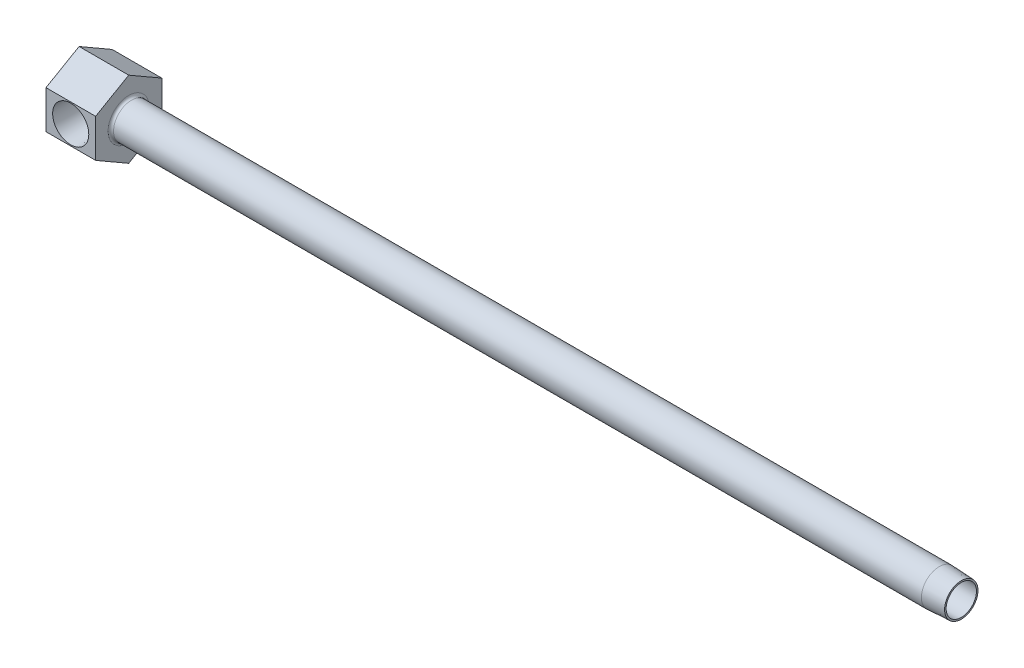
ISO-10303-21;
HEADER;
FILE_DESCRIPTION(('STEP AP214'),'2;1');
FILE_NAME('part.step','',(''),(''),'','','');
FILE_SCHEMA(('AUTOMOTIVE_DESIGN { 1 0 10303 214 1 1 1 1 }'));
ENDSEC;
DATA;
#1=APPLICATION_CONTEXT('core data for automotive mechanical design processes');
#2=APPLICATION_PROTOCOL_DEFINITION('international standard','automotive_design',2000,#1);
#3=PRODUCT_CONTEXT('',#1,'mechanical');
#4=PRODUCT('Part','Part','',(#3));
#5=PRODUCT_RELATED_PRODUCT_CATEGORY('part','',(#4));
#6=PRODUCT_DEFINITION_FORMATION('','',#4);
#7=PRODUCT_DEFINITION_CONTEXT('part definition',#1,'design');
#8=PRODUCT_DEFINITION('design','',#6,#7);
#9=PRODUCT_DEFINITION_SHAPE('','',#8);
#10=(LENGTH_UNIT() NAMED_UNIT(*) SI_UNIT(.MILLI.,.METRE.));
#11=(NAMED_UNIT(*) PLANE_ANGLE_UNIT() SI_UNIT($,.RADIAN.));
#12=(NAMED_UNIT(*) SI_UNIT($,.STERADIAN.) SOLID_ANGLE_UNIT());
#13=UNCERTAINTY_MEASURE_WITH_UNIT(LENGTH_MEASURE(1.E-05),#10,'distance_accuracy_value','');
#14=(GEOMETRIC_REPRESENTATION_CONTEXT(3) GLOBAL_UNCERTAINTY_ASSIGNED_CONTEXT((#13)) GLOBAL_UNIT_ASSIGNED_CONTEXT((#10,
#11,#12)) REPRESENTATION_CONTEXT('',''));
#15=CARTESIAN_POINT('',(0.,0.,0.));
#16=DIRECTION('',(0.,0.,1.));
#17=DIRECTION('',(1.,0.,0.));
#18=AXIS2_PLACEMENT_3D('',#15,#16,#17);
#19=CARTESIAN_POINT('',(7.14375,0.,9.525));
#20=DIRECTION('',(1.,0.,0.));
#21=DIRECTION('',(0.,0.,-1.));
#22=AXIS2_PLACEMENT_3D('',#19,#20,#21);
#23=PLANE('',#22);
#24=DIRECTION('',(0.,0.,1.));
#25=VECTOR('',#24,1.);
#26=CARTESIAN_POINT('',(7.14375,4.21628045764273,19.05));
#27=LINE('',#26,#25);
#28=CARTESIAN_POINT('',(7.14375,4.21628045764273,8.39289543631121));
#29=VERTEX_POINT('',#28);
#30=CARTESIAN_POINT('',(7.14375,4.21628045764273,10.16));
#31=VERTEX_POINT('',#30);
#32=EDGE_CURVE('E280',#29,#31,#27,.T.);
#33=ORIENTED_EDGE('',*,*,#32,.F.);
#34=CARTESIAN_POINT('',(7.14375,0.,9.525));
#35=DIRECTION('',(1.,0.,0.));
#36=DIRECTION('',(0.,0.,-1.));
#37=AXIS2_PLACEMENT_3D('',#34,#35,#36);
#38=CIRCLE('',#37,4.365625);
#39=CARTESIAN_POINT('',(7.14375,4.31919629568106,10.16));
#40=VERTEX_POINT('',#39);
#41=EDGE_CURVE('E163',#29,#40,#38,.T.);
#42=ORIENTED_EDGE('',*,*,#41,.T.);
#43=DIRECTION('',(0.,1.,0.));
#44=VECTOR('',#43,1.);
#45=CARTESIAN_POINT('',(7.14375,0.,10.16));
#46=LINE('',#45,#44);
#47=EDGE_CURVE('E153',#31,#40,#46,.T.);
#48=ORIENTED_EDGE('',*,*,#47,.F.);
#49=EDGE_LOOP('',(#33,#42,#48));
#50=FACE_BOUND('',#49,.T.);
#51=ADVANCED_FACE('F15',(#50),#23,.T.);
#52=CARTESIAN_POINT('',(14.2875,5.4992613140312,19.05));
#53=DIRECTION('',(0.,0.,-1.));
#54=DIRECTION('',(-1.,0.,0.));
#55=AXIS2_PLACEMENT_3D('',#52,#53,#54);
#56=PLANE('',#55);
#57=CARTESIAN_POINT('',(7.112,0.,19.05));
#58=DIRECTION('',(0.,0.,1.));
#59=DIRECTION('',(1.,0.,0.));
#60=AXIS2_PLACEMENT_3D('',#57,#58,#59);
#61=CIRCLE('',#60,5.2023645);
#62=CARTESIAN_POINT('',(12.3143645,0.,19.05));
#63=VERTEX_POINT('',#62);
#64=EDGE_CURVE('E269',#63,#63,#61,.T.);
#65=ORIENTED_EDGE('',*,*,#64,.F.);
#66=EDGE_LOOP('',(#65));
#67=FACE_BOUND('',#66,.T.);
#68=DIRECTION('',(0.,-1.,0.));
#69=VECTOR('',#68,1.);
#70=CARTESIAN_POINT('',(0.,5.4992613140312,19.05));
#71=LINE('',#70,#69);
#72=CARTESIAN_POINT('',(0.,5.4992613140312,19.05));
#73=VERTEX_POINT('',#72);
#74=CARTESIAN_POINT('',(0.,-5.49926131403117,19.05));
#75=VERTEX_POINT('',#74);
#76=EDGE_CURVE('E178',#73,#75,#71,.T.);
#77=ORIENTED_EDGE('',*,*,#76,.T.);
#78=DIRECTION('',(-1.,0.,0.));
#79=VECTOR('',#78,1.);
#80=CARTESIAN_POINT('',(14.2875,-5.49926131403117,19.05));
#81=LINE('',#80,#79);
#82=CARTESIAN_POINT('',(14.2875,-5.49926131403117,19.05));
#83=VERTEX_POINT('',#82);
#84=EDGE_CURVE('E201',#83,#75,#81,.T.);
#85=ORIENTED_EDGE('',*,*,#84,.F.);
#86=DIRECTION('',(0.,-1.,0.));
#87=VECTOR('',#86,1.);
#88=CARTESIAN_POINT('',(14.2875,5.4992613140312,19.05));
#89=LINE('',#88,#87);
#90=CARTESIAN_POINT('',(14.2875,5.4992613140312,19.05));
#91=VERTEX_POINT('',#90);
#92=EDGE_CURVE('E194',#91,#83,#89,.T.);
#93=ORIENTED_EDGE('',*,*,#92,.F.);
#94=DIRECTION('',(-1.,0.,0.));
#95=VECTOR('',#94,1.);
#96=CARTESIAN_POINT('',(14.2875,5.4992613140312,19.05));
#97=LINE('',#96,#95);
#98=EDGE_CURVE('E204',#91,#73,#97,.T.);
#99=ORIENTED_EDGE('',*,*,#98,.T.);
#100=EDGE_LOOP('',(#77,#85,#93,#99));
#101=FACE_BOUND('',#100,.T.);
#102=ADVANCED_FACE('F119',(#67,#101),#56,.F.);
#103=CARTESIAN_POINT('',(14.2875,-5.49926131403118,0.));
#104=DIRECTION('',(1.,0.,0.));
#105=DIRECTION('',(0.,1.,0.));
#106=AXIS2_PLACEMENT_3D('',#103,#104,#105);
#107=PLANE('',#106);
#108=CARTESIAN_POINT('',(14.2875,0.,9.525));
#109=DIRECTION('',(1.,0.,0.));
#110=DIRECTION('',(0.,1.,0.));
#111=AXIS2_PLACEMENT_3D('',#108,#109,#110);
#112=CIRCLE('',#111,5.9309);
#113=CARTESIAN_POINT('',(14.2875,5.9309,9.525));
#114=VERTEX_POINT('',#113);
#115=EDGE_CURVE('E216',#114,#114,#112,.F.);
#116=ORIENTED_EDGE('',*,*,#115,.T.);
#117=EDGE_LOOP('',(#116));
#118=FACE_BOUND('',#117,.T.);
#119=DIRECTION('',(0.,0.5,-0.866025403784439));
#120=VECTOR('',#119,1.);
#121=CARTESIAN_POINT('',(14.2875,-10.9985226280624,9.525));
#122=LINE('',#121,#120);
#123=CARTESIAN_POINT('',(14.2875,-10.9985226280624,9.525));
#124=VERTEX_POINT('',#123);
#125=CARTESIAN_POINT('',(14.2875,-5.49926131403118,0.));
#126=VERTEX_POINT('',#125);
#127=EDGE_CURVE('E184',#124,#126,#122,.T.);
#128=ORIENTED_EDGE('',*,*,#127,.T.);
#129=DIRECTION('',(0.,1.,0.));
#130=VECTOR('',#129,1.);
#131=CARTESIAN_POINT('',(14.2875,-5.49926131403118,0.));
#132=LINE('',#131,#130);
#133=CARTESIAN_POINT('',(14.2875,5.49926131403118,0.));
#134=VERTEX_POINT('',#133);
#135=EDGE_CURVE('E188',#126,#134,#132,.T.);
#136=ORIENTED_EDGE('',*,*,#135,.T.);
#137=DIRECTION('',(0.,0.5,0.866025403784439));
#138=VECTOR('',#137,1.);
#139=CARTESIAN_POINT('',(14.2875,5.49926131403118,0.));
#140=LINE('',#139,#138);
#141=CARTESIAN_POINT('',(14.2875,10.9985226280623,9.525));
#142=VERTEX_POINT('',#141);
#143=EDGE_CURVE('E190',#134,#142,#140,.T.);
#144=ORIENTED_EDGE('',*,*,#143,.T.);
#145=DIRECTION('',(0.,-0.5,0.86602540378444));
#146=VECTOR('',#145,1.);
#147=CARTESIAN_POINT('',(14.2875,10.9985226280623,9.525));
#148=LINE('',#147,#146);
#149=EDGE_CURVE('E192',#142,#91,#148,.T.);
#150=ORIENTED_EDGE('',*,*,#149,.T.);
#151=ORIENTED_EDGE('',*,*,#92,.T.);
#152=DIRECTION('',(0.,-0.5,-0.866025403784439));
#153=VECTOR('',#152,1.);
#154=CARTESIAN_POINT('',(14.2875,-5.49926131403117,19.05));
#155=LINE('',#154,#153);
#156=EDGE_CURVE('E38',#83,#124,#155,.T.);
#157=ORIENTED_EDGE('',*,*,#156,.T.);
#158=EDGE_LOOP('',(#128,#136,#144,#150,#151,#157));
#159=FACE_BOUND('',#158,.T.);
#160=ADVANCED_FACE('F127',(#118,#159),#107,.T.);
#161=CARTESIAN_POINT('',(14.2875,-10.9985226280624,9.525));
#162=DIRECTION('',(0.,0.866025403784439,0.5));
#163=DIRECTION('',(0.,-0.5,0.866025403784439));
#164=AXIS2_PLACEMENT_3D('',#161,#162,#163);
#165=PLANE('',#164);
#166=DIRECTION('',(0.,0.5,-0.866025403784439));
#167=VECTOR('',#166,1.);
#168=CARTESIAN_POINT('',(0.,-10.9985226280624,9.525));
#169=LINE('',#168,#167);
#170=CARTESIAN_POINT('',(0.,-10.9985226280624,9.525));
#171=VERTEX_POINT('',#170);
#172=CARTESIAN_POINT('',(0.,-5.49926131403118,0.));
#173=VERTEX_POINT('',#172);
#174=EDGE_CURVE('E166',#171,#173,#169,.T.);
#175=ORIENTED_EDGE('',*,*,#174,.T.);
#176=DIRECTION('',(-1.,0.,0.));
#177=VECTOR('',#176,1.);
#178=CARTESIAN_POINT('',(14.2875,-5.49926131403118,0.));
#179=LINE('',#178,#177);
#180=EDGE_CURVE('E213',#126,#173,#179,.T.);
#181=ORIENTED_EDGE('',*,*,#180,.F.);
#182=ORIENTED_EDGE('',*,*,#127,.F.);
#183=DIRECTION('',(-1.,0.,0.));
#184=VECTOR('',#183,1.);
#185=CARTESIAN_POINT('',(14.2875,-10.9985226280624,9.525));
#186=LINE('',#185,#184);
#187=EDGE_CURVE('E197',#124,#171,#186,.T.);
#188=ORIENTED_EDGE('',*,*,#187,.T.);
#189=EDGE_LOOP('',(#175,#181,#182,#188));
#190=FACE_BOUND('',#189,.T.);
#191=ADVANCED_FACE('F301',(#190),#165,.F.);
#192=CARTESIAN_POINT('',(14.2875,-5.49926131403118,0.));
#193=DIRECTION('',(0.,0.,1.));
#194=DIRECTION('',(0.,-1.,0.));
#195=AXIS2_PLACEMENT_3D('',#192,#193,#194);
#196=PLANE('',#195);
#197=DIRECTION('',(0.,1.,0.));
#198=VECTOR('',#197,1.);
#199=CARTESIAN_POINT('',(0.,-5.49926131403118,0.));
#200=LINE('',#199,#198);
#201=CARTESIAN_POINT('',(0.,5.49926131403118,0.));
#202=VERTEX_POINT('',#201);
#203=EDGE_CURVE('E169',#173,#202,#200,.T.);
#204=ORIENTED_EDGE('',*,*,#203,.T.);
#205=DIRECTION('',(-1.,0.,0.));
#206=VECTOR('',#205,1.);
#207=CARTESIAN_POINT('',(14.2875,5.49926131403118,0.));
#208=LINE('',#207,#206);
#209=EDGE_CURVE('E210',#134,#202,#208,.T.);
#210=ORIENTED_EDGE('',*,*,#209,.F.);
#211=ORIENTED_EDGE('',*,*,#135,.F.);
#212=ORIENTED_EDGE('',*,*,#180,.T.);
#213=EDGE_LOOP('',(#204,#210,#211,#212));
#214=FACE_BOUND('',#213,.T.);
#215=ADVANCED_FACE('F307',(#214),#196,.F.);
#216=CARTESIAN_POINT('',(14.2875,5.49926131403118,0.));
#217=DIRECTION('',(0.,-0.866025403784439,0.5));
#218=DIRECTION('',(0.,-0.5,-0.866025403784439));
#219=AXIS2_PLACEMENT_3D('',#216,#217,#218);
#220=PLANE('',#219);
#221=DIRECTION('',(0.,0.5,0.866025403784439));
#222=VECTOR('',#221,1.);
#223=CARTESIAN_POINT('',(0.,5.49926131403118,0.));
#224=LINE('',#223,#222);
#225=CARTESIAN_POINT('',(0.,10.9985226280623,9.525));
#226=VERTEX_POINT('',#225);
#227=EDGE_CURVE('E172',#202,#226,#224,.T.);
#228=ORIENTED_EDGE('',*,*,#227,.T.);
#229=DIRECTION('',(-1.,0.,0.));
#230=VECTOR('',#229,1.);
#231=CARTESIAN_POINT('',(14.2875,10.9985226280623,9.525));
#232=LINE('',#231,#230);
#233=EDGE_CURVE('E207',#142,#226,#232,.T.);
#234=ORIENTED_EDGE('',*,*,#233,.F.);
#235=ORIENTED_EDGE('',*,*,#143,.F.);
#236=ORIENTED_EDGE('',*,*,#209,.T.);
#237=EDGE_LOOP('',(#228,#234,#235,#236));
#238=FACE_BOUND('',#237,.T.);
#239=ADVANCED_FACE('F309',(#238),#220,.F.);
#240=CARTESIAN_POINT('',(14.2875,10.9985226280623,9.525));
#241=DIRECTION('',(0.,-0.86602540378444,-0.5));
#242=DIRECTION('',(0.,0.5,-0.86602540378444));
#243=AXIS2_PLACEMENT_3D('',#240,#241,#242);
#244=PLANE('',#243);
#245=DIRECTION('',(0.,-0.5,0.86602540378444));
#246=VECTOR('',#245,1.);
#247=CARTESIAN_POINT('',(0.,10.9985226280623,9.525));
#248=LINE('',#247,#246);
#249=EDGE_CURVE('E175',#226,#73,#248,.T.);
#250=ORIENTED_EDGE('',*,*,#249,.T.);
#251=ORIENTED_EDGE('',*,*,#98,.F.);
#252=ORIENTED_EDGE('',*,*,#149,.F.);
#253=ORIENTED_EDGE('',*,*,#233,.T.);
#254=EDGE_LOOP('',(#250,#251,#252,#253));
#255=FACE_BOUND('',#254,.T.);
#256=ADVANCED_FACE('F312',(#255),#244,.F.);
#257=CARTESIAN_POINT('',(14.2875,-5.49926131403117,19.05));
#258=DIRECTION('',(0.,0.866025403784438,-0.5));
#259=DIRECTION('',(0.,0.5,0.866025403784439));
#260=AXIS2_PLACEMENT_3D('',#257,#258,#259);
#261=PLANE('',#260);
#262=DIRECTION('',(0.,-0.5,-0.866025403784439));
#263=VECTOR('',#262,1.);
#264=CARTESIAN_POINT('',(0.,-5.49926131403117,19.05));
#265=LINE('',#264,#263);
#266=EDGE_CURVE('E181',#75,#171,#265,.T.);
#267=ORIENTED_EDGE('',*,*,#266,.T.);
#268=ORIENTED_EDGE('',*,*,#187,.F.);
#269=ORIENTED_EDGE('',*,*,#156,.F.);
#270=ORIENTED_EDGE('',*,*,#84,.T.);
#271=EDGE_LOOP('',(#267,#268,#269,#270));
#272=FACE_BOUND('',#271,.T.);
#273=ADVANCED_FACE('F296',(#272),#261,.F.);
#274=CARTESIAN_POINT('',(0.,-5.49926131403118,0.));
#275=DIRECTION('',(1.,0.,0.));
#276=DIRECTION('',(0.,1.,0.));
#277=AXIS2_PLACEMENT_3D('',#274,#275,#276);
#278=PLANE('',#277);
#279=ORIENTED_EDGE('',*,*,#174,.F.);
#280=ORIENTED_EDGE('',*,*,#266,.F.);
#281=ORIENTED_EDGE('',*,*,#76,.F.);
#282=ORIENTED_EDGE('',*,*,#249,.F.);
#283=ORIENTED_EDGE('',*,*,#227,.F.);
#284=ORIENTED_EDGE('',*,*,#203,.F.);
#285=EDGE_LOOP('',(#279,#280,#281,#282,#283,#284));
#286=FACE_BOUND('',#285,.T.);
#287=ADVANCED_FACE('F141',(#286),#278,.F.);
#288=CARTESIAN_POINT('',(68.0114010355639,0.,9.525));
#289=DIRECTION('',(-1.,0.,0.));
#290=DIRECTION('',(0.,0.,1.));
#291=AXIS2_PLACEMENT_3D('',#288,#289,#290);
#292=CYLINDRICAL_SURFACE('',#291,5.1435);
#293=CARTESIAN_POINT('',(247.65,0.,9.525));
#294=DIRECTION('',(-1.,0.,0.));
#295=DIRECTION('',(0.,0.,1.));
#296=AXIS2_PLACEMENT_3D('',#293,#294,#295);
#297=CIRCLE('',#296,5.1435);
#298=CARTESIAN_POINT('',(247.65,0.,14.6685));
#299=VERTEX_POINT('',#298);
#300=EDGE_CURVE('E10',#299,#299,#297,.F.);
#301=ORIENTED_EDGE('',*,*,#300,.F.);
#302=EDGE_LOOP('',(#301));
#303=FACE_BOUND('',#302,.T.);
#304=CARTESIAN_POINT('',(15.0749,0.,9.525));
#305=DIRECTION('',(1.,0.,0.));
#306=DIRECTION('',(0.,1.,0.));
#307=AXIS2_PLACEMENT_3D('',#304,#305,#306);
#308=CIRCLE('',#307,5.1435);
#309=CARTESIAN_POINT('',(15.0749,5.1435,9.525));
#310=VERTEX_POINT('',#309);
#311=EDGE_CURVE('E219',#310,#310,#308,.T.);
#312=ORIENTED_EDGE('',*,*,#311,.T.);
#313=EDGE_LOOP('',(#312));
#314=FACE_BOUND('',#313,.T.);
#315=ADVANCED_FACE('F17',(#303,#314),#292,.T.);
#316=CARTESIAN_POINT('',(7.14375,-4.31919629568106,10.16));
#317=VERTEX_POINT('',#316);
#318=CARTESIAN_POINT('',(7.14375,-4.21628045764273,10.16));
#319=VERTEX_POINT('',#318);
#320=EDGE_CURVE('E146',#317,#319,#46,.T.);
#321=ORIENTED_EDGE('',*,*,#320,.F.);
#322=CARTESIAN_POINT('',(7.14375,-4.21628045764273,8.39289543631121));
#323=VERTEX_POINT('',#322);
#324=EDGE_CURVE('E148',#317,#323,#38,.T.);
#325=ORIENTED_EDGE('',*,*,#324,.T.);
#326=DIRECTION('',(0.,0.,1.));
#327=VECTOR('',#326,1.);
#328=CARTESIAN_POINT('',(7.14375,-4.21628045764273,19.05));
#329=LINE('',#328,#327);
#330=EDGE_CURVE('E149',#319,#323,#329,.F.);
#331=ORIENTED_EDGE('',*,*,#330,.F.);
#332=EDGE_LOOP('',(#321,#325,#331));
#333=FACE_BOUND('',#332,.T.);
#334=ADVANCED_FACE('F122',(#333),#23,.T.);
#335=CARTESIAN_POINT('',(66.1375087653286,0.,9.525));
#336=DIRECTION('',(1.,0.,0.));
#337=DIRECTION('',(0.,0.,-1.));
#338=AXIS2_PLACEMENT_3D('',#335,#336,#337);
#339=CYLINDRICAL_SURFACE('',#338,4.365625);
#340=DIRECTION('',(1.,0.,0.));
#341=VECTOR('',#340,1.);
#342=CARTESIAN_POINT('',(66.1375087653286,4.31919629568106,10.16));
#343=LINE('',#342,#341);
#344=CARTESIAN_POINT('',(9.50166012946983,4.31919629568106,10.16));
#345=VERTEX_POINT('',#344);
#346=EDGE_CURVE('E23',#40,#345,#343,.T.);
#347=ORIENTED_EDGE('',*,*,#346,.F.);
#348=ORIENTED_EDGE('',*,*,#41,.F.);
#349=CARTESIAN_POINT('',(11.0152606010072,1.5945487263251,5.461));
#350=CARTESIAN_POINT('',(10.9690910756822,1.7075595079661,5.50534166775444));
#351=CARTESIAN_POINT('',(10.9186455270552,1.81703423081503,5.55373339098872));
#352=CARTESIAN_POINT('',(10.810302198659,2.02846645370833,5.65746242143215));
#353=CARTESIAN_POINT('',(10.7524192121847,2.13043826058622,5.71278593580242));
#354=CARTESIAN_POINT('',(10.5698905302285,2.42358040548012,5.88682744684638));
#355=CARTESIAN_POINT('',(10.4356317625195,2.6037024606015,6.01432367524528));
#356=CARTESIAN_POINT('',(10.2004726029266,2.87382153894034,6.2358690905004));
#357=CARTESIAN_POINT('',(10.1051285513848,2.97281573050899,6.32528321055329));
#358=CARTESIAN_POINT('',(9.90783434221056,3.15907014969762,6.50903483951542));
#359=CARTESIAN_POINT('',(9.80588273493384,3.2463277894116,6.60337342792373));
#360=CARTESIAN_POINT('',(9.59613587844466,3.40951469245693,6.79556583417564));
#361=CARTESIAN_POINT('',(9.48833347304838,3.48542963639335,6.89342390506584));
#362=CARTESIAN_POINT('',(9.26745878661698,3.62617881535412,7.09103053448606));
#363=CARTESIAN_POINT('',(9.15438825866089,3.69101670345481,7.19077845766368));
#364=CARTESIAN_POINT('',(8.91700112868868,3.81296593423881,7.39547820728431));
#365=CARTESIAN_POINT('',(8.79240497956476,3.86952009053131,7.50043788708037));
#366=CARTESIAN_POINT('',(8.53587575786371,3.97111492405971,7.70779573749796));
#367=CARTESIAN_POINT('',(8.40392330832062,4.01612325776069,7.81018600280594));
#368=CARTESIAN_POINT('',(8.16304729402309,4.0847277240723,7.98226690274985));
#369=CARTESIAN_POINT('',(8.0562781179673,4.11086974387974,8.05387458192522));
#370=CARTESIAN_POINT('',(7.89027521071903,4.14432560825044,8.15224503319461));
#371=CARTESIAN_POINT('',(7.83425575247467,4.15448196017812,8.18339689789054));
#372=CARTESIAN_POINT('',(7.71975817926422,4.17277321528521,8.24142733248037));
#373=CARTESIAN_POINT('',(7.6612817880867,4.18090950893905,8.26830883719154));
#374=CARTESIAN_POINT('',(7.52931857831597,4.19631734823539,8.32062856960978));
#375=CARTESIAN_POINT('',(7.45518069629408,4.2030846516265,8.34468558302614));
#376=CARTESIAN_POINT('',(7.30234246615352,4.21282137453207,8.37996487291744));
#377=CARTESIAN_POINT('',(7.22358315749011,4.21571837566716,8.39094201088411));
#378=CARTESIAN_POINT('',(7.14374999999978,4.21628045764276,8.39289543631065));
#379=B_SPLINE_CURVE_WITH_KNOTS('',3,(#349,#350,#351,#352,#353,#354,#355,#356,#357,#358,#359,
#360,#361,#362,#363,#364,#365,#366,#367,#368,#369,#370,#371,#372,#373,#374,#375,#376,#377,#378),
.UNSPECIFIED.,.F.,.F.,(4,2,2,2,2,2,2,2,2,2,2,2,2,2,4),(0.,0.389178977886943,0.777595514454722,
1.54850925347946,2.03989074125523,2.5313804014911,3.02348538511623,3.51542776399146,
4.03226982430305,4.5505442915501,4.94339994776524,5.13792303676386,5.33231185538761,
5.56585330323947,5.80370611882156),.UNSPECIFIED.);
#380=CARTESIAN_POINT('',(11.0152606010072,1.5945487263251,5.461));
#381=VERTEX_POINT('',#380);
#382=EDGE_CURVE('E222',#381,#29,#379,.T.);
#383=ORIENTED_EDGE('',*,*,#382,.F.);
#384=CARTESIAN_POINT('',(11.038608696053,-1.66986531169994,5.4913625));
#385=CARTESIAN_POINT('',(11.0105354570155,-1.5831922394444,5.45544731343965));
#386=CARTESIAN_POINT('',(10.985979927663,-1.49442111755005,5.422003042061));
#387=CARTESIAN_POINT('',(10.9431209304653,-1.31365154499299,5.36062405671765));
#388=CARTESIAN_POINT('',(10.9248095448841,-1.22165734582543,5.3326823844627));
#389=CARTESIAN_POINT('',(10.8936059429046,-1.03529168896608,5.28281066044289));
#390=CARTESIAN_POINT('',(10.8807075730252,-0.94092306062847,5.26087379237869));
#391=CARTESIAN_POINT('',(10.8594086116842,-0.750424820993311,5.22325970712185));
#392=CARTESIAN_POINT('',(10.8510094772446,-0.654294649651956,5.20758451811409));
#393=CARTESIAN_POINT('',(10.8381415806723,-0.463156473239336,5.18296779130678));
#394=CARTESIAN_POINT('',(10.8335877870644,-0.368172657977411,5.1738812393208));
#395=CARTESIAN_POINT('',(10.8276558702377,-0.177678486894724,5.16194794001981));
#396=CARTESIAN_POINT('',(10.8262790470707,-0.0821679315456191,5.15910374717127));
#397=CARTESIAN_POINT('',(10.826564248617,0.108822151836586,5.15968693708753));
#398=CARTESIAN_POINT('',(10.828226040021,0.204301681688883,5.16311383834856));
#399=CARTESIAN_POINT('',(10.8347557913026,0.3946850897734,5.17620642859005));
#400=CARTESIAN_POINT('',(10.8396224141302,0.489589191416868,5.18586951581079));
#401=CARTESIAN_POINT('',(10.8530224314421,0.678329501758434,5.2113452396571));
#402=CARTESIAN_POINT('',(10.861556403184,0.772165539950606,5.22715884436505));
#403=CARTESIAN_POINT('',(10.882977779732,0.958108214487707,5.26475262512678));
#404=CARTESIAN_POINT('',(10.8958637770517,1.05021539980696,5.28653087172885));
#405=CARTESIAN_POINT('',(10.9268394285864,1.23213175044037,5.33579934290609));
#406=CARTESIAN_POINT('',(10.9449350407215,1.32193815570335,5.36329609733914));
#407=CARTESIAN_POINT('',(10.9870994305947,1.49845562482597,5.42352620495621));
#408=CARTESIAN_POINT('',(11.0111754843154,1.58516276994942,5.45626591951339));
#409=CARTESIAN_POINT('',(11.038608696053,1.66986531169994,5.4913625));
#410=B_SPLINE_CURVE_WITH_KNOTS('',3,(#384,#385,#386,#387,#388,#389,#390,#391,#392,#393,#394,
#395,#396,#397,#398,#399,#400,#401,#402,#403,#404,#405,#406,#407,#408,#409),.UNSPECIFIED.,.F.,
.F.,(4,2,2,2,2,2,2,2,2,2,2,2,4),(0.,0.293591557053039,0.586809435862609,0.879693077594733,
1.17267150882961,1.45898777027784,1.74542117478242,2.03183258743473,2.31812458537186,
2.60446166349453,2.89070622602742,3.17727945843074,3.46420306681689),.UNSPECIFIED.);
#411=CARTESIAN_POINT('',(11.0152606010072,-1.5945487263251,5.461));
#412=VERTEX_POINT('',#411);
#413=EDGE_CURVE('E227',#412,#381,#410,.T.);
#414=ORIENTED_EDGE('',*,*,#413,.F.);
#415=CARTESIAN_POINT('',(7.14375,-4.21628045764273,8.39289543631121));
#416=CARTESIAN_POINT('',(7.18362399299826,-4.21598583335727,8.39181806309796));
#417=CARTESIAN_POINT('',(7.22338201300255,-4.21511517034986,8.38855660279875));
#418=CARTESIAN_POINT('',(7.30220974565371,-4.21229002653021,8.3781194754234));
#419=CARTESIAN_POINT('',(7.34128135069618,-4.21033927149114,8.37095726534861));
#420=CARTESIAN_POINT('',(7.45558593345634,-4.20306181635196,8.34463096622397));
#421=CARTESIAN_POINT('',(7.52959005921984,-4.19629141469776,8.32054287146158));
#422=CARTESIAN_POINT('',(7.67793141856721,-4.17895935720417,8.2616842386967));
#423=CARTESIAN_POINT('',(7.75200183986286,-4.16818767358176,8.22634138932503));
#424=CARTESIAN_POINT('',(7.89635080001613,-4.14345087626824,8.14945009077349));
#425=CARTESIAN_POINT('',(7.96662283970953,-4.12948049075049,8.10789143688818));
#426=CARTESIAN_POINT('',(8.10525974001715,-4.09836535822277,8.02024615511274));
#427=CARTESIAN_POINT('',(8.17357097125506,-4.08117012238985,7.97409391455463));
#428=CARTESIAN_POINT('',(8.30769836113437,-4.04390532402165,7.87936489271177));
#429=CARTESIAN_POINT('',(8.37351346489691,-4.02383456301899,7.83078710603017));
#430=CARTESIAN_POINT('',(8.57859672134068,-3.95588469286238,7.67482924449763));
#431=CARTESIAN_POINT('',(8.71418056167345,-3.90283307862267,7.56482866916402));
#432=CARTESIAN_POINT('',(8.97841531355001,-3.78358080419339,7.34346052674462));
#433=CARTESIAN_POINT('',(9.10705932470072,-3.71736735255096,7.23209172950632));
#434=CARTESIAN_POINT('',(9.35705912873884,-3.57190642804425,7.01153592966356));
#435=CARTESIAN_POINT('',(9.47845600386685,-3.49274436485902,6.90233956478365));
#436=CARTESIAN_POINT('',(9.71438396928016,-3.32067953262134,6.68762551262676));
#437=CARTESIAN_POINT('',(9.82891987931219,-3.22778657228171,6.58210526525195));
#438=CARTESIAN_POINT('',(10.0969445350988,-2.98549279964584,6.33327532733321));
#439=CARTESIAN_POINT('',(10.2465325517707,-2.82876640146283,6.19275827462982));
#440=CARTESIAN_POINT('',(10.5251240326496,-2.48539491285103,5.92944140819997));
#441=CARTESIAN_POINT('',(10.6541872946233,-2.29884003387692,5.80659022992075));
#442=CARTESIAN_POINT('',(10.815064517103,-2.01834728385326,5.65289947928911));
#443=CARTESIAN_POINT('',(10.8584525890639,-1.93670806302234,5.61137999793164));
#444=CARTESIAN_POINT('',(10.9405236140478,-1.76894321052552,5.53274400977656));
#445=CARTESIAN_POINT('',(10.9792015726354,-1.6828129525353,5.49563217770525));
#446=CARTESIAN_POINT('',(11.0152606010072,-1.5945487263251,5.461));
#447=B_SPLINE_CURVE_WITH_KNOTS('',3,(#415,#416,#417,#418,#419,#420,#421,#422,#423,#424,#425,
#426,#427,#428,#429,#430,#431,#432,#433,#434,#435,#436,#437,#438,#439,#440,#441,#442,#443,#444,
#445,#446),.UNSPECIFIED.,.F.,.F.,(4,2,2,2,2,2,2,2,2,2,2,2,2,2,2,4),(0.,0.119524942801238,
0.238640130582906,0.471907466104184,0.719716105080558,0.967936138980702,1.2204276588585,
1.47302472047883,2.01967972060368,2.56686861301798,3.1105838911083,3.65391262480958,
4.4259772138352,5.19574951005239,5.49953103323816,5.80363192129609),.UNSPECIFIED.);
#448=EDGE_CURVE('E162',#323,#412,#447,.T.);
#449=ORIENTED_EDGE('',*,*,#448,.F.);
#450=ORIENTED_EDGE('',*,*,#324,.F.);
#451=DIRECTION('',(1.,0.,0.));
#452=VECTOR('',#451,1.);
#453=CARTESIAN_POINT('',(66.1375087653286,-4.31919629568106,10.16));
#454=LINE('',#453,#452);
#455=CARTESIAN_POINT('',(9.50166012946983,-4.31919629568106,10.16));
#456=VERTEX_POINT('',#455);
#457=EDGE_CURVE('E160',#456,#317,#454,.F.);
#458=ORIENTED_EDGE('',*,*,#457,.F.);
#459=CARTESIAN_POINT('',(9.50159462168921,4.31922569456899,10.1598));
#460=CARTESIAN_POINT('',(9.52205476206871,4.31004461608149,10.2222542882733));
#461=CARTESIAN_POINT('',(9.54440879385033,4.29961032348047,10.2838517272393));
#462=CARTESIAN_POINT('',(9.592244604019,4.27639816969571,10.4052958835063));
#463=CARTESIAN_POINT('',(9.61772301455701,4.26362282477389,10.4651444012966));
#464=CARTESIAN_POINT('',(9.6977084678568,4.22211002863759,10.641720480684));
#465=CARTESIAN_POINT('',(9.75594525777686,4.19010742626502,10.7559937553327));
#466=CARTESIAN_POINT('',(9.87844694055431,4.11827910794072,10.9783012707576));
#467=CARTESIAN_POINT('',(9.94270165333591,4.07846648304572,11.0863455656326));
#468=CARTESIAN_POINT('',(10.0748723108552,3.9913538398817,11.2972300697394));
#469=CARTESIAN_POINT('',(10.1427929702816,3.94404402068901,11.4000632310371));
#470=CARTESIAN_POINT('',(10.298774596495,3.82856370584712,11.6276502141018));
#471=CARTESIAN_POINT('',(10.3873705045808,3.75819622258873,11.7509249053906));
#472=CARTESIAN_POINT('',(10.5646676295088,3.60591330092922,11.9899830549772));
#473=CARTESIAN_POINT('',(10.6533688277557,3.52399966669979,12.1057676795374));
#474=CARTESIAN_POINT('',(10.828903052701,3.34837324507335,12.3298815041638));
#475=CARTESIAN_POINT('',(10.9157338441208,3.25464716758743,12.4382020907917));
#476=CARTESIAN_POINT('',(11.0854790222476,3.05533823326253,12.6465978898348));
#477=CARTESIAN_POINT('',(11.1683947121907,2.94975936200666,12.746675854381));
#478=CARTESIAN_POINT('',(11.3637298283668,2.67738871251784,12.9797077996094));
#479=CARTESIAN_POINT('',(11.4730979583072,2.50408908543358,13.1077769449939));
#480=CARTESIAN_POINT('',(11.6736784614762,2.13317678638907,13.3402290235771));
#481=CARTESIAN_POINT('',(11.764930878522,1.93561933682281,13.444664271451));
#482=CARTESIAN_POINT('',(11.9092563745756,1.55445058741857,13.608817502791));
#483=CARTESIAN_POINT('',(11.9662034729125,1.37434002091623,13.6731460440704));
#484=CARTESIAN_POINT('',(12.036275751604,1.09545803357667,13.7520594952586));
#485=CARTESIAN_POINT('',(12.0570798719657,1.00100886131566,13.7754393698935));
#486=CARTESIAN_POINT('',(12.093196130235,0.80976989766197,13.8159777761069));
#487=CARTESIAN_POINT('',(12.1085105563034,0.712981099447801,13.8331388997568));
#488=CARTESIAN_POINT('',(12.1334016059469,0.517219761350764,13.861011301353));
#489=CARTESIAN_POINT('',(12.1429475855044,0.418238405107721,13.8716881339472));
#490=CARTESIAN_POINT('',(12.1559671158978,0.219418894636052,13.8862461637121));
#491=CARTESIAN_POINT('',(12.159443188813,0.119581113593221,13.8901301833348));
#492=CARTESIAN_POINT('',(12.1602489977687,-0.0801622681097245,13.8910308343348));
#493=CARTESIAN_POINT('',(12.157578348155,-0.180067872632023,13.8880470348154));
#494=CARTESIAN_POINT('',(12.1461610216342,-0.379063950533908,13.87528173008));
#495=CARTESIAN_POINT('',(12.1374146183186,-0.478154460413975,13.8655005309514));
#496=CARTESIAN_POINT('',(12.1041501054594,-0.757548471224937,13.8282625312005));
#497=CARTESIAN_POINT('',(12.0725539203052,-0.936048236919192,13.7928583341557));
#498=CARTESIAN_POINT('',(11.9914510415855,-1.28332325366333,13.701614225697));
#499=CARTESIAN_POINT('',(11.9419389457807,-1.45209555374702,13.645768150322));
#500=CARTESIAN_POINT('',(11.8234161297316,-1.78986703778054,13.5113020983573));
#501=CARTESIAN_POINT('',(11.7531886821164,-1.95786359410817,13.4312490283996));
#502=CARTESIAN_POINT('',(11.5990616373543,-2.2774775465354,13.2539727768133));
#503=CARTESIAN_POINT('',(11.515160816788,-2.42909347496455,13.1567480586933));
#504=CARTESIAN_POINT('',(11.2893838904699,-2.79222476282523,12.8919364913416));
#505=CARTESIAN_POINT('',(11.1405152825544,-2.99235864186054,12.7145443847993));
#506=CARTESIAN_POINT('',(10.9077049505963,-3.26312100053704,12.4281267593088));
#507=CARTESIAN_POINT('',(10.8282461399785,-3.34869576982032,12.3289140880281));
#508=CARTESIAN_POINT('',(10.6676325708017,-3.51003537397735,12.1240974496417));
#509=CARTESIAN_POINT('',(10.5864785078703,-3.58580414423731,12.0184960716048));
#510=CARTESIAN_POINT('',(10.4220303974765,-3.72941202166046,11.798300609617));
#511=CARTESIAN_POINT('',(10.338734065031,-3.79700254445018,11.6835467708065));
#512=CARTESIAN_POINT('',(10.1740816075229,-3.92201333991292,11.4470806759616));
#513=CARTESIAN_POINT('',(10.092727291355,-3.97942442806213,11.3253622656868));
#514=CARTESIAN_POINT('',(9.93568225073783,-4.08324264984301,11.0754774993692));
#515=CARTESIAN_POINT('',(9.85994825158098,-4.12974154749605,10.9473767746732));
#516=CARTESIAN_POINT('',(9.71779756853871,-4.21155620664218,10.6828322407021));
#517=CARTESIAN_POINT('',(9.65135922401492,-4.24689821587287,10.5464089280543));
#518=CARTESIAN_POINT('',(9.57628126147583,-4.28419371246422,10.3652627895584));
#519=CARTESIAN_POINT('',(9.56028735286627,-4.29194911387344,10.3247361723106));
#520=CARTESIAN_POINT('',(9.52977406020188,-4.30640007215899,10.2428664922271));
#521=CARTESIAN_POINT('',(9.51525722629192,-4.31309380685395,10.2015221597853));
#522=CARTESIAN_POINT('',(9.50159462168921,-4.31922569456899,10.1598));
#523=B_SPLINE_CURVE_WITH_KNOTS('',3,(#459,#460,#461,#462,#463,#464,#465,#466,#467,#468,#469,
#470,#471,#472,#473,#474,#475,#476,#477,#478,#479,#480,#481,#482,#483,#484,#485,#486,#487,#488,
#489,#490,#491,#492,#493,#494,#495,#496,#497,#498,#499,#500,#501,#502,#503,#504,#505,#506,#507,
#508,#509,#510,#511,#512,#513,#514,#515,#516,#517,#518,#519,#520,#521,#522),.UNSPECIFIED.,.F.,
.F.,(4,2,2,2,2,2,2,2,2,2,2,2,2,2,2,2,2,2,2,2,2,2,2,2,2,2,2,2,2,2,2,4),(0.,0.19895577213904,
0.397698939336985,0.793542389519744,1.1887279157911,1.58443438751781,2.08580736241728,
2.58710208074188,3.08896592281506,3.5906615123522,4.3128774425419,5.03347872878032,
5.62940645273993,5.92758657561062,6.22564226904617,6.52526772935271,6.82476866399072,
7.12428839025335,7.4237946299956,7.97525228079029,8.52687635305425,9.12138980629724,
9.71595648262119,10.6287987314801,11.0881817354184,11.5473798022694,12.018174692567,
12.4893922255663,12.9564924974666,13.4224855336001,13.5552077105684,13.6881552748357),.UNSPECIFIED.);
#524=EDGE_CURVE('E241',#345,#456,#523,.T.);
#525=ORIENTED_EDGE('',*,*,#524,.F.);
#526=EDGE_LOOP('',(#347,#348,#383,#414,#449,#450,#458,#525));
#527=FACE_BOUND('',#526,.T.);
#528=CARTESIAN_POINT('',(254.,0.,9.525));
#529=DIRECTION('',(1.,0.,0.));
#530=DIRECTION('',(0.,0.,-1.));
#531=AXIS2_PLACEMENT_3D('',#528,#529,#530);
#532=CIRCLE('',#531,4.365625);
#533=CARTESIAN_POINT('',(254.,0.,5.159375));
#534=VERTEX_POINT('',#533);
#535=EDGE_CURVE('E267',#534,#534,#532,.T.);
#536=ORIENTED_EDGE('',*,*,#535,.T.);
#537=EDGE_LOOP('',(#536));
#538=FACE_BOUND('',#537,.T.);
#539=ADVANCED_FACE('F114',(#527,#538),#339,.F.);
#540=CARTESIAN_POINT('',(15.0749,0.,9.525));
#541=DIRECTION('',(1.,0.,0.));
#542=DIRECTION('',(0.,1.,0.));
#543=AXIS2_PLACEMENT_3D('',#540,#541,#542);
#544=TOROIDAL_SURFACE('',#543,5.9309,0.7874);
#545=ORIENTED_EDGE('',*,*,#311,.F.);
#546=EDGE_LOOP('',(#545));
#547=FACE_BOUND('',#546,.T.);
#548=ORIENTED_EDGE('',*,*,#115,.F.);
#549=EDGE_LOOP('',(#548));
#550=FACE_BOUND('',#549,.T.);
#551=ADVANCED_FACE('F103',(#547,#550),#544,.F.);
#552=CARTESIAN_POINT('',(7.112,0.,5.461));
#553=DIRECTION('',(0.,0.,1.));
#554=DIRECTION('',(1.,0.,0.));
#555=AXIS2_PLACEMENT_3D('',#552,#553,#554);
#556=CONICAL_SURFACE('',#555,4.2164,1.02974425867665);
#557=ORIENTED_EDGE('',*,*,#413,.T.);
#558=CARTESIAN_POINT('',(7.112,0.,5.461));
#559=DIRECTION('',(0.,0.,1.));
#560=DIRECTION('',(1.,0.,0.));
#561=AXIS2_PLACEMENT_3D('',#558,#559,#560);
#562=CIRCLE('',#561,4.2164);
#563=EDGE_CURVE('E30',#381,#412,#562,.T.);
#564=ORIENTED_EDGE('',*,*,#563,.T.);
#565=EDGE_LOOP('',(#557,#564));
#566=FACE_BOUND('',#565,.T.);
#567=CARTESIAN_POINT('',(7.112,0.,2.92753128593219));
#568=VERTEX_POINT('',#567);
#569=VERTEX_LOOP('',#568);
#570=FACE_BOUND('',#569,.T.);
#571=ADVANCED_FACE('F100',(#566,#570),#556,.F.);
#572=CARTESIAN_POINT('',(7.112,0.,19.05));
#573=DIRECTION('',(0.,0.,1.));
#574=DIRECTION('',(1.,0.,0.));
#575=AXIS2_PLACEMENT_3D('',#572,#573,#574);
#576=CYLINDRICAL_SURFACE('',#575,4.2164);
#577=ORIENTED_EDGE('',*,*,#330,.T.);
#578=ORIENTED_EDGE('',*,*,#448,.T.);
#579=ORIENTED_EDGE('',*,*,#563,.F.);
#580=ORIENTED_EDGE('',*,*,#382,.T.);
#581=ORIENTED_EDGE('',*,*,#32,.T.);
#582=CARTESIAN_POINT('',(7.112,0.,10.16));
#583=DIRECTION('',(0.,0.,1.));
#584=DIRECTION('',(1.,0.,0.));
#585=AXIS2_PLACEMENT_3D('',#582,#583,#584);
#586=CIRCLE('',#585,4.2164);
#587=EDGE_CURVE('E277',#31,#319,#586,.T.);
#588=ORIENTED_EDGE('',*,*,#587,.T.);
#589=EDGE_LOOP('',(#577,#578,#579,#580,#581,#588));
#590=FACE_BOUND('',#589,.T.);
#591=ADVANCED_FACE('F102',(#590),#576,.F.);
#592=CARTESIAN_POINT('',(11.3284,0.,10.16));
#593=DIRECTION('',(0.,0.,-1.));
#594=DIRECTION('',(-1.,0.,0.));
#595=AXIS2_PLACEMENT_3D('',#592,#593,#594);
#596=PLANE('',#595);
#597=ORIENTED_EDGE('',*,*,#47,.T.);
#598=ORIENTED_EDGE('',*,*,#346,.T.);
#599=CARTESIAN_POINT('',(7.112,0.,10.16));
#600=DIRECTION('',(0.,0.,1.));
#601=DIRECTION('',(1.,0.,0.));
#602=AXIS2_PLACEMENT_3D('',#599,#600,#601);
#603=CIRCLE('',#602,4.93618599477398);
#604=EDGE_CURVE('E274',#345,#456,#603,.T.);
#605=ORIENTED_EDGE('',*,*,#604,.T.);
#606=ORIENTED_EDGE('',*,*,#457,.T.);
#607=ORIENTED_EDGE('',*,*,#320,.T.);
#608=ORIENTED_EDGE('',*,*,#587,.F.);
#609=EDGE_LOOP('',(#597,#598,#605,#606,#607,#608));
#610=FACE_BOUND('',#609,.T.);
#611=ADVANCED_FACE('F112',(#610),#596,.F.);
#612=CARTESIAN_POINT('',(7.112,0.,19.05));
#613=DIRECTION('',(0.,0.,1.));
#614=DIRECTION('',(1.,0.,0.));
#615=AXIS2_PLACEMENT_3D('',#612,#613,#614);
#616=CONICAL_SURFACE('',#615,5.2023645,0.0299323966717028);
#617=ORIENTED_EDGE('',*,*,#524,.T.);
#618=ORIENTED_EDGE('',*,*,#604,.F.);
#619=EDGE_LOOP('',(#617,#618));
#620=FACE_BOUND('',#619,.T.);
#621=ORIENTED_EDGE('',*,*,#64,.T.);
#622=EDGE_LOOP('',(#621));
#623=FACE_BOUND('',#622,.T.);
#624=ADVANCED_FACE('F246',(#620,#623),#616,.F.);
#625=CARTESIAN_POINT('',(254.,0.,9.525));
#626=DIRECTION('',(-1.,0.,0.));
#627=DIRECTION('',(0.,0.,1.));
#628=AXIS2_PLACEMENT_3D('',#625,#626,#627);
#629=CONICAL_SURFACE('',#628,4.81071060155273,0.052359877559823);
#630=ORIENTED_EDGE('',*,*,#300,.T.);
#631=EDGE_LOOP('',(#630));
#632=FACE_BOUND('',#631,.T.);
#633=CARTESIAN_POINT('',(254.,0.,9.525));
#634=DIRECTION('',(1.,0.,0.));
#635=DIRECTION('',(0.,0.,-1.));
#636=AXIS2_PLACEMENT_3D('',#633,#634,#635);
#637=CIRCLE('',#636,4.81071060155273);
#638=CARTESIAN_POINT('',(254.,0.,4.71428939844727));
#639=VERTEX_POINT('',#638);
#640=EDGE_CURVE('E264',#639,#639,#637,.T.);
#641=ORIENTED_EDGE('',*,*,#640,.F.);
#642=EDGE_LOOP('',(#641));
#643=FACE_BOUND('',#642,.T.);
#644=ADVANCED_FACE('F250',(#632,#643),#629,.T.);
#645=CARTESIAN_POINT('',(254.,0.,5.159375));
#646=DIRECTION('',(1.,0.,0.));
#647=DIRECTION('',(0.,0.,-1.));
#648=AXIS2_PLACEMENT_3D('',#645,#646,#647);
#649=PLANE('',#648);
#650=ORIENTED_EDGE('',*,*,#640,.T.);
#651=EDGE_LOOP('',(#650));
#652=FACE_BOUND('',#651,.T.);
#653=ORIENTED_EDGE('',*,*,#535,.F.);
#654=EDGE_LOOP('',(#653));
#655=FACE_BOUND('',#654,.T.);
#656=ADVANCED_FACE('F254',(#652,#655),#649,.T.);
#657=CLOSED_SHELL('',(#51,#102,#160,#191,#215,#239,#256,#273,#287,#315,#334,#539,#551,#571,#591,
#611,#624,#644,#656));
#658=MANIFOLD_SOLID_BREP('B1',#657);
#659=ADVANCED_BREP_SHAPE_REPRESENTATION('',(#18,#658),#14);
#660=SHAPE_DEFINITION_REPRESENTATION(#9,#659);
ENDSEC;
END-ISO-10303-21;
